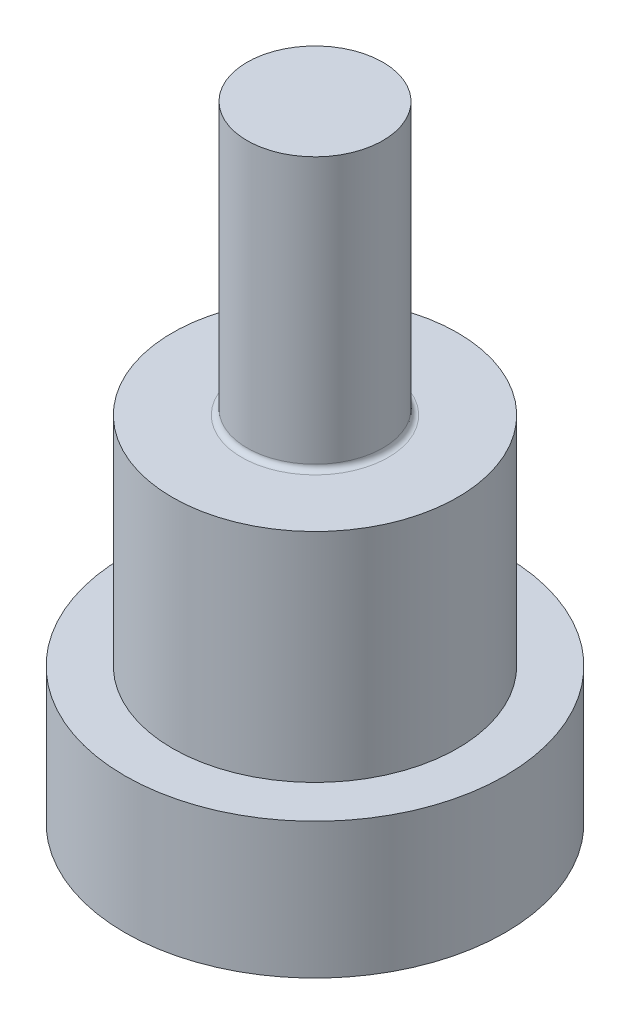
ISO-10303-21;
HEADER;
FILE_DESCRIPTION(('STEP AP214'),'2;1');
FILE_NAME('part.step','',(''),(''),'','','');
FILE_SCHEMA(('AUTOMOTIVE_DESIGN { 1 0 10303 214 1 1 1 1 }'));
ENDSEC;
DATA;
#1=APPLICATION_CONTEXT('core data for automotive mechanical design processes');
#2=APPLICATION_PROTOCOL_DEFINITION('international standard','automotive_design',2000,#1);
#3=PRODUCT_CONTEXT('',#1,'mechanical');
#4=PRODUCT('Part','Part','',(#3));
#5=PRODUCT_RELATED_PRODUCT_CATEGORY('part','',(#4));
#6=PRODUCT_DEFINITION_FORMATION('','',#4);
#7=PRODUCT_DEFINITION_CONTEXT('part definition',#1,'design');
#8=PRODUCT_DEFINITION('design','',#6,#7);
#9=PRODUCT_DEFINITION_SHAPE('','',#8);
#10=(LENGTH_UNIT() NAMED_UNIT(*) SI_UNIT(.MILLI.,.METRE.));
#11=(NAMED_UNIT(*) PLANE_ANGLE_UNIT() SI_UNIT($,.RADIAN.));
#12=(NAMED_UNIT(*) SI_UNIT($,.STERADIAN.) SOLID_ANGLE_UNIT());
#13=UNCERTAINTY_MEASURE_WITH_UNIT(LENGTH_MEASURE(1.E-05),#10,'distance_accuracy_value','');
#14=(GEOMETRIC_REPRESENTATION_CONTEXT(3) GLOBAL_UNCERTAINTY_ASSIGNED_CONTEXT((#13)) GLOBAL_UNIT_ASSIGNED_CONTEXT((#10,
#11,#12)) REPRESENTATION_CONTEXT('',''));
#15=CARTESIAN_POINT('',(0.,0.,0.));
#16=DIRECTION('',(0.,0.,1.));
#17=DIRECTION('',(1.,0.,0.));
#18=AXIS2_PLACEMENT_3D('',#15,#16,#17);
#19=CARTESIAN_POINT('',(0.,-6.,0.));
#20=DIRECTION('',(0.,-1.,0.));
#21=DIRECTION('',(-0.546944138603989,0.,0.837169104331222));
#22=AXIS2_PLACEMENT_3D('',#19,#20,#21);
#23=PLANE('',#22);
#24=CARTESIAN_POINT('',(0.,-6.,0.));
#25=DIRECTION('',(0.,-1.,0.));
#26=DIRECTION('',(-0.546944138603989,0.,0.837169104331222));
#27=AXIS2_PLACEMENT_3D('',#24,#25,#26);
#28=CIRCLE('',#27,3.2);
#29=CARTESIAN_POINT('',(-1.75022124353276,-6.,2.67894113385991));
#30=VERTEX_POINT('',#29);
#31=EDGE_CURVE('E123',#30,#30,#28,.F.);
#32=ORIENTED_EDGE('',*,*,#31,.T.);
#33=EDGE_LOOP('',(#32));
#34=FACE_BOUND('',#33,.T.);
#35=CARTESIAN_POINT('',(0.,-6.,0.));
#36=DIRECTION('',(0.,-1.,0.));
#37=DIRECTION('',(0.,0.,-1.));
#38=AXIS2_PLACEMENT_3D('',#35,#36,#37);
#39=CIRCLE('',#38,7.);
#40=CARTESIAN_POINT('',(0.,-6.,-7.));
#41=VERTEX_POINT('',#40);
#42=EDGE_CURVE('E393',#41,#41,#39,.T.);
#43=ORIENTED_EDGE('',*,*,#42,.T.);
#44=EDGE_LOOP('',(#43));
#45=FACE_BOUND('',#44,.T.);
#46=ADVANCED_FACE('F16',(#34,#45),#23,.T.);
#47=CARTESIAN_POINT('',(0.,-2.,0.));
#48=DIRECTION('',(0.,-1.,0.));
#49=DIRECTION('',(-0.546944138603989,0.,0.837169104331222));
#50=AXIS2_PLACEMENT_3D('',#47,#48,#49);
#51=CYLINDRICAL_SURFACE('',#50,3.);
#52=CARTESIAN_POINT('',(0.,-5.8,0.));
#53=DIRECTION('',(0.,-1.,0.));
#54=DIRECTION('',(-0.546944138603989,0.,0.837169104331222));
#55=AXIS2_PLACEMENT_3D('',#52,#53,#54);
#56=CIRCLE('',#55,3.);
#57=CARTESIAN_POINT('',(-1.64083241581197,-5.8,2.51150731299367));
#58=VERTEX_POINT('',#57);
#59=EDGE_CURVE('E126',#58,#58,#56,.T.);
#60=ORIENTED_EDGE('',*,*,#59,.T.);
#61=EDGE_LOOP('',(#60));
#62=FACE_BOUND('',#61,.T.);
#63=CARTESIAN_POINT('',(0.,-2.,0.));
#64=DIRECTION('',(0.,-1.,0.));
#65=DIRECTION('',(-0.546944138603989,0.,0.837169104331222));
#66=AXIS2_PLACEMENT_3D('',#63,#64,#65);
#67=CIRCLE('',#66,3.);
#68=CARTESIAN_POINT('',(-1.64083241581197,-2.,2.51150731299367));
#69=VERTEX_POINT('',#68);
#70=EDGE_CURVE('E120',#69,#69,#67,.T.);
#71=ORIENTED_EDGE('',*,*,#70,.F.);
#72=EDGE_LOOP('',(#71));
#73=FACE_BOUND('',#72,.T.);
#74=ADVANCED_FACE('F160',(#62,#73),#51,.F.);
#75=CARTESIAN_POINT('',(0.,-5.8,0.));
#76=DIRECTION('',(0.,-1.,0.));
#77=DIRECTION('',(-0.546944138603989,0.,0.837169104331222));
#78=AXIS2_PLACEMENT_3D('',#75,#76,#77);
#79=CONICAL_SURFACE('',#78,3.,0.785398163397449);
#80=ORIENTED_EDGE('',*,*,#31,.F.);
#81=EDGE_LOOP('',(#80));
#82=FACE_BOUND('',#81,.T.);
#83=ORIENTED_EDGE('',*,*,#59,.F.);
#84=EDGE_LOOP('',(#83));
#85=FACE_BOUND('',#84,.T.);
#86=ADVANCED_FACE('F167',(#82,#85),#79,.F.);
#87=CARTESIAN_POINT('',(0.,-2.,0.));
#88=DIRECTION('',(0.,-1.,0.));
#89=DIRECTION('',(0.,0.,-1.));
#90=AXIS2_PLACEMENT_3D('',#87,#88,#89);
#91=PLANE('',#90);
#92=CARTESIAN_POINT('',(0.,-2.,0.));
#93=DIRECTION('',(0.,-1.,0.));
#94=DIRECTION('',(0.,0.,-1.));
#95=AXIS2_PLACEMENT_3D('',#92,#93,#94);
#96=CIRCLE('',#95,2.75);
#97=CARTESIAN_POINT('',(0.,-2.,-2.75000000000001));
#98=VERTEX_POINT('',#97);
#99=EDGE_CURVE('E10',#98,#98,#96,.T.);
#100=ORIENTED_EDGE('',*,*,#99,.F.);
#101=EDGE_LOOP('',(#100));
#102=FACE_BOUND('',#101,.T.);
#103=ORIENTED_EDGE('',*,*,#70,.T.);
#104=EDGE_LOOP('',(#103));
#105=FACE_BOUND('',#104,.T.);
#106=ADVANCED_FACE('F177',(#102,#105),#91,.T.);
#107=CARTESIAN_POINT('',(0.,-3.5,1.44337567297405));
#108=DIRECTION('',(-0.5,0.,-0.86602540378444));
#109=DIRECTION('',(0.86602540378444,0.,-0.5));
#110=AXIS2_PLACEMENT_3D('',#107,#108,#109);
#111=PLANE('',#110);
#112=DIRECTION('',(0.,-1.,0.));
#113=VECTOR('',#112,1.);
#114=CARTESIAN_POINT('',(1.25,-3.5,0.721687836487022));
#115=LINE('',#114,#113);
#116=CARTESIAN_POINT('',(1.25,-3.5,0.721687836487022));
#117=VERTEX_POINT('',#116);
#118=CARTESIAN_POINT('',(1.25,-5.,0.721687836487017));
#119=VERTEX_POINT('',#118);
#120=EDGE_CURVE('E65',#117,#119,#115,.T.);
#121=ORIENTED_EDGE('',*,*,#120,.T.);
#122=DIRECTION('',(0.866025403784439,0.,-0.5));
#123=VECTOR('',#122,1.);
#124=CARTESIAN_POINT('',(0.,-5.,1.44337567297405));
#125=LINE('',#124,#123);
#126=CARTESIAN_POINT('',(0.,-5.,1.44337567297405));
#127=VERTEX_POINT('',#126);
#128=EDGE_CURVE('E31',#127,#119,#125,.T.);
#129=ORIENTED_EDGE('',*,*,#128,.F.);
#130=DIRECTION('',(0.,-1.,0.));
#131=VECTOR('',#130,1.);
#132=CARTESIAN_POINT('',(0.,-3.5,1.44337567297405));
#133=LINE('',#132,#131);
#134=CARTESIAN_POINT('',(0.,-3.5,1.44337567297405));
#135=VERTEX_POINT('',#134);
#136=EDGE_CURVE('E35',#135,#127,#133,.T.);
#137=ORIENTED_EDGE('',*,*,#136,.F.);
#138=DIRECTION('',(0.866025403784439,0.,-0.5));
#139=VECTOR('',#138,1.);
#140=CARTESIAN_POINT('',(0.,-3.5,1.44337567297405));
#141=LINE('',#140,#139);
#142=EDGE_CURVE('E68',#135,#117,#141,.T.);
#143=ORIENTED_EDGE('',*,*,#142,.T.);
#144=EDGE_LOOP('',(#121,#129,#137,#143));
#145=FACE_BOUND('',#144,.T.);
#146=ADVANCED_FACE('F67',(#145),#111,.T.);
#147=CARTESIAN_POINT('',(1.25,-3.5,-0.721687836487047));
#148=DIRECTION('',(1.,0.,0.));
#149=DIRECTION('',(0.,0.,1.));
#150=AXIS2_PLACEMENT_3D('',#147,#148,#149);
#151=PLANE('',#150);
#152=DIRECTION('',(0.,-1.,0.));
#153=VECTOR('',#152,1.);
#154=CARTESIAN_POINT('',(1.25,-3.5,-0.721687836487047));
#155=LINE('',#154,#153);
#156=CARTESIAN_POINT('',(1.25,-3.5,-0.721687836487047));
#157=VERTEX_POINT('',#156);
#158=CARTESIAN_POINT('',(1.25,-5.,-0.721687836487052));
#159=VERTEX_POINT('',#158);
#160=EDGE_CURVE('E73',#157,#159,#155,.T.);
#161=ORIENTED_EDGE('',*,*,#160,.T.);
#162=DIRECTION('',(0.,0.,1.));
#163=VECTOR('',#162,1.);
#164=CARTESIAN_POINT('',(1.25,-5.,-0.721687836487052));
#165=LINE('',#164,#163);
#166=EDGE_CURVE('E76',#159,#119,#165,.T.);
#167=ORIENTED_EDGE('',*,*,#166,.T.);
#168=ORIENTED_EDGE('',*,*,#120,.F.);
#169=DIRECTION('',(0.,0.,1.));
#170=VECTOR('',#169,1.);
#171=CARTESIAN_POINT('',(1.25,-3.5,-0.721687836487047));
#172=LINE('',#171,#170);
#173=EDGE_CURVE('E107',#157,#117,#172,.T.);
#174=ORIENTED_EDGE('',*,*,#173,.F.);
#175=EDGE_LOOP('',(#161,#167,#168,#174));
#176=FACE_BOUND('',#175,.T.);
#177=ADVANCED_FACE('F77',(#176),#151,.F.);
#178=CARTESIAN_POINT('',(0.,-3.5,-1.44337567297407));
#179=DIRECTION('',(0.5,0.,-0.86602540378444));
#180=DIRECTION('',(0.86602540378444,0.,0.5));
#181=AXIS2_PLACEMENT_3D('',#178,#179,#180);
#182=PLANE('',#181);
#183=DIRECTION('',(0.,-1.,0.));
#184=VECTOR('',#183,1.);
#185=CARTESIAN_POINT('',(0.,-3.5,-1.44337567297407));
#186=LINE('',#185,#184);
#187=CARTESIAN_POINT('',(0.,-3.5,-1.44337567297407));
#188=VERTEX_POINT('',#187);
#189=CARTESIAN_POINT('',(0.,-5.,-1.44337567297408));
#190=VERTEX_POINT('',#189);
#191=EDGE_CURVE('E115',#188,#190,#186,.T.);
#192=ORIENTED_EDGE('',*,*,#191,.T.);
#193=DIRECTION('',(0.86602540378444,0.,0.5));
#194=VECTOR('',#193,1.);
#195=CARTESIAN_POINT('',(0.,-5.,-1.44337567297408));
#196=LINE('',#195,#194);
#197=EDGE_CURVE('E81',#190,#159,#196,.T.);
#198=ORIENTED_EDGE('',*,*,#197,.T.);
#199=ORIENTED_EDGE('',*,*,#160,.F.);
#200=DIRECTION('',(0.86602540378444,0.,0.5));
#201=VECTOR('',#200,1.);
#202=CARTESIAN_POINT('',(0.,-3.5,-1.44337567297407));
#203=LINE('',#202,#201);
#204=EDGE_CURVE('E104',#188,#157,#203,.T.);
#205=ORIENTED_EDGE('',*,*,#204,.F.);
#206=EDGE_LOOP('',(#192,#198,#199,#205));
#207=FACE_BOUND('',#206,.T.);
#208=ADVANCED_FACE('F222',(#207),#182,.F.);
#209=CARTESIAN_POINT('',(0.,-3.5,-1.44337567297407));
#210=DIRECTION('',(0.5,0.,0.86602540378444));
#211=DIRECTION('',(-0.86602540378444,0.,0.5));
#212=AXIS2_PLACEMENT_3D('',#209,#210,#211);
#213=PLANE('',#212);
#214=DIRECTION('',(0.,-1.,0.));
#215=VECTOR('',#214,1.);
#216=CARTESIAN_POINT('',(-1.25,-3.5,-0.721687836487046));
#217=LINE('',#216,#215);
#218=CARTESIAN_POINT('',(-1.25,-3.5,-0.721687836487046));
#219=VERTEX_POINT('',#218);
#220=CARTESIAN_POINT('',(-1.25,-5.,-0.721687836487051));
#221=VERTEX_POINT('',#220);
#222=EDGE_CURVE('E113',#219,#221,#217,.T.);
#223=ORIENTED_EDGE('',*,*,#222,.T.);
#224=DIRECTION('',(-0.86602540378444,0.,0.5));
#225=VECTOR('',#224,1.);
#226=CARTESIAN_POINT('',(0.,-5.,-1.44337567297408));
#227=LINE('',#226,#225);
#228=EDGE_CURVE('E384',#190,#221,#227,.T.);
#229=ORIENTED_EDGE('',*,*,#228,.F.);
#230=ORIENTED_EDGE('',*,*,#191,.F.);
#231=DIRECTION('',(-0.86602540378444,0.,0.5));
#232=VECTOR('',#231,1.);
#233=CARTESIAN_POINT('',(0.,-3.5,-1.44337567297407));
#234=LINE('',#233,#232);
#235=EDGE_CURVE('E101',#188,#219,#234,.T.);
#236=ORIENTED_EDGE('',*,*,#235,.T.);
#237=EDGE_LOOP('',(#223,#229,#230,#236));
#238=FACE_BOUND('',#237,.T.);
#239=ADVANCED_FACE('F215',(#238),#213,.T.);
#240=CARTESIAN_POINT('',(-1.25,-3.5,0.721687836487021));
#241=DIRECTION('',(-1.,0.,0.));
#242=DIRECTION('',(0.,0.,-1.));
#243=AXIS2_PLACEMENT_3D('',#240,#241,#242);
#244=PLANE('',#243);
#245=DIRECTION('',(0.,-1.,0.));
#246=VECTOR('',#245,1.);
#247=CARTESIAN_POINT('',(-1.25,-3.5,0.721687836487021));
#248=LINE('',#247,#246);
#249=CARTESIAN_POINT('',(-1.25,-3.5,0.721687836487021));
#250=VERTEX_POINT('',#249);
#251=CARTESIAN_POINT('',(-1.25,-5.,0.721687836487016));
#252=VERTEX_POINT('',#251);
#253=EDGE_CURVE('E111',#250,#252,#248,.T.);
#254=ORIENTED_EDGE('',*,*,#253,.T.);
#255=DIRECTION('',(0.,0.,-1.));
#256=VECTOR('',#255,1.);
#257=CARTESIAN_POINT('',(-1.25,-5.,0.721687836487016));
#258=LINE('',#257,#256);
#259=EDGE_CURVE('E386',#252,#221,#258,.T.);
#260=ORIENTED_EDGE('',*,*,#259,.T.);
#261=ORIENTED_EDGE('',*,*,#222,.F.);
#262=DIRECTION('',(0.,0.,-1.));
#263=VECTOR('',#262,1.);
#264=CARTESIAN_POINT('',(-1.25,-3.5,0.721687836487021));
#265=LINE('',#264,#263);
#266=EDGE_CURVE('E98',#250,#219,#265,.T.);
#267=ORIENTED_EDGE('',*,*,#266,.F.);
#268=EDGE_LOOP('',(#254,#260,#261,#267));
#269=FACE_BOUND('',#268,.T.);
#270=ADVANCED_FACE('F207',(#269),#244,.F.);
#271=CARTESIAN_POINT('',(0.,-3.5,1.44337567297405));
#272=DIRECTION('',(-0.5,0.,0.86602540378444));
#273=DIRECTION('',(-0.86602540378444,0.,-0.5));
#274=AXIS2_PLACEMENT_3D('',#271,#272,#273);
#275=PLANE('',#274);
#276=DIRECTION('',(-0.86602540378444,0.,-0.5));
#277=VECTOR('',#276,1.);
#278=CARTESIAN_POINT('',(0.,-3.5,1.44337567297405));
#279=LINE('',#278,#277);
#280=EDGE_CURVE('E95',#135,#250,#279,.T.);
#281=ORIENTED_EDGE('',*,*,#280,.F.);
#282=ORIENTED_EDGE('',*,*,#136,.T.);
#283=DIRECTION('',(-0.86602540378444,0.,-0.5));
#284=VECTOR('',#283,1.);
#285=CARTESIAN_POINT('',(0.,-5.,1.44337567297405));
#286=LINE('',#285,#284);
#287=EDGE_CURVE('E87',#127,#252,#286,.T.);
#288=ORIENTED_EDGE('',*,*,#287,.T.);
#289=ORIENTED_EDGE('',*,*,#253,.F.);
#290=EDGE_LOOP('',(#281,#282,#288,#289));
#291=FACE_BOUND('',#290,.T.);
#292=ADVANCED_FACE('F200',(#291),#275,.F.);
#293=CARTESIAN_POINT('',(1.25,-3.5,0.721687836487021));
#294=DIRECTION('',(0.,-1.,0.));
#295=DIRECTION('',(1.,0.,0.));
#296=AXIS2_PLACEMENT_3D('',#293,#294,#295);
#297=PLANE('',#296);
#298=ORIENTED_EDGE('',*,*,#142,.F.);
#299=ORIENTED_EDGE('',*,*,#280,.T.);
#300=ORIENTED_EDGE('',*,*,#266,.T.);
#301=ORIENTED_EDGE('',*,*,#235,.F.);
#302=ORIENTED_EDGE('',*,*,#204,.T.);
#303=ORIENTED_EDGE('',*,*,#173,.T.);
#304=EDGE_LOOP('',(#298,#299,#300,#301,#302,#303));
#305=FACE_BOUND('',#304,.T.);
#306=ADVANCED_FACE('F199',(#305),#297,.T.);
#307=CARTESIAN_POINT('',(0.,-5.,0.));
#308=DIRECTION('',(0.,-1.,0.));
#309=DIRECTION('',(1.,0.,0.));
#310=AXIS2_PLACEMENT_3D('',#307,#308,#309);
#311=PLANE('',#310);
#312=CARTESIAN_POINT('',(0.,-5.,0.));
#313=DIRECTION('',(0.,-1.,0.));
#314=DIRECTION('',(1.,0.,0.));
#315=AXIS2_PLACEMENT_3D('',#312,#313,#314);
#316=CIRCLE('',#315,2.75);
#317=CARTESIAN_POINT('',(2.75,-5.,0.));
#318=VERTEX_POINT('',#317);
#319=EDGE_CURVE('E72',#318,#318,#316,.T.);
#320=ORIENTED_EDGE('',*,*,#319,.T.);
#321=EDGE_LOOP('',(#320));
#322=FACE_BOUND('',#321,.T.);
#323=ORIENTED_EDGE('',*,*,#287,.F.);
#324=ORIENTED_EDGE('',*,*,#128,.T.);
#325=ORIENTED_EDGE('',*,*,#166,.F.);
#326=ORIENTED_EDGE('',*,*,#197,.F.);
#327=ORIENTED_EDGE('',*,*,#228,.T.);
#328=ORIENTED_EDGE('',*,*,#259,.F.);
#329=EDGE_LOOP('',(#323,#324,#325,#326,#327,#328));
#330=FACE_BOUND('',#329,.T.);
#331=ADVANCED_FACE('F84',(#322,#330),#311,.T.);
#332=CARTESIAN_POINT('',(0.,-17.,0.));
#333=DIRECTION('',(0.,-1.,0.));
#334=DIRECTION('',(1.,0.,0.));
#335=AXIS2_PLACEMENT_3D('',#332,#333,#334);
#336=CYLINDRICAL_SURFACE('',#335,2.75);
#337=ORIENTED_EDGE('',*,*,#99,.T.);
#338=EDGE_LOOP('',(#337));
#339=FACE_BOUND('',#338,.T.);
#340=ORIENTED_EDGE('',*,*,#319,.F.);
#341=EDGE_LOOP('',(#340));
#342=FACE_BOUND('',#341,.T.);
#343=ADVANCED_FACE('F191',(#339,#342),#336,.T.);
#344=CARTESIAN_POINT('',(0.,17.,0.));
#345=DIRECTION('',(0.,-1.,0.));
#346=DIRECTION('',(0.,0.,-1.));
#347=AXIS2_PLACEMENT_3D('',#344,#345,#346);
#348=PLANE('',#347);
#349=CARTESIAN_POINT('',(0.,17.,0.));
#350=DIRECTION('',(0.,-1.,0.));
#351=DIRECTION('',(0.,0.,-1.));
#352=AXIS2_PLACEMENT_3D('',#349,#350,#351);
#353=CIRCLE('',#352,2.5);
#354=CARTESIAN_POINT('',(0.,17.,-2.5));
#355=VERTEX_POINT('',#354);
#356=EDGE_CURVE('E88',#355,#355,#353,.T.);
#357=ORIENTED_EDGE('',*,*,#356,.F.);
#358=EDGE_LOOP('',(#357));
#359=FACE_BOUND('',#358,.T.);
#360=ADVANCED_FACE('F194',(#359),#348,.F.);
#361=CARTESIAN_POINT('',(0.,17.,0.));
#362=DIRECTION('',(0.,1.,0.));
#363=DIRECTION('',(0.,0.,1.));
#364=AXIS2_PLACEMENT_3D('',#361,#362,#363);
#365=CYLINDRICAL_SURFACE('',#364,2.5);
#366=CARTESIAN_POINT('',(0.,7.2,0.));
#367=DIRECTION('',(0.,-1.,0.));
#368=DIRECTION('',(0.,0.,-1.));
#369=AXIS2_PLACEMENT_3D('',#366,#367,#368);
#370=CIRCLE('',#369,2.5);
#371=CARTESIAN_POINT('',(0.,7.2,-2.5));
#372=VERTEX_POINT('',#371);
#373=EDGE_CURVE('E132',#372,#372,#370,.F.);
#374=ORIENTED_EDGE('',*,*,#373,.T.);
#375=EDGE_LOOP('',(#374));
#376=FACE_BOUND('',#375,.T.);
#377=ORIENTED_EDGE('',*,*,#356,.T.);
#378=EDGE_LOOP('',(#377));
#379=FACE_BOUND('',#378,.T.);
#380=ADVANCED_FACE('F353',(#376,#379),#365,.T.);
#381=CARTESIAN_POINT('',(0.,7.2,0.));
#382=DIRECTION('',(0.,-1.,0.));
#383=DIRECTION('',(0.,0.,-1.));
#384=AXIS2_PLACEMENT_3D('',#381,#382,#383);
#385=TOROIDAL_SURFACE('',#384,2.7,0.2);
#386=CARTESIAN_POINT('',(0.,7.,0.));
#387=DIRECTION('',(0.,-1.,0.));
#388=DIRECTION('',(0.,0.,-1.));
#389=AXIS2_PLACEMENT_3D('',#386,#387,#388);
#390=CIRCLE('',#389,2.7);
#391=CARTESIAN_POINT('',(0.,7.,-2.7));
#392=VERTEX_POINT('',#391);
#393=EDGE_CURVE('E135',#392,#392,#390,.T.);
#394=ORIENTED_EDGE('',*,*,#393,.F.);
#395=EDGE_LOOP('',(#394));
#396=FACE_BOUND('',#395,.T.);
#397=ORIENTED_EDGE('',*,*,#373,.F.);
#398=EDGE_LOOP('',(#397));
#399=FACE_BOUND('',#398,.T.);
#400=ADVANCED_FACE('F18',(#396,#399),#385,.F.);
#401=CARTESIAN_POINT('',(2.5,7.,0.));
#402=DIRECTION('',(0.,-1.,0.));
#403=DIRECTION('',(0.,0.,-1.));
#404=AXIS2_PLACEMENT_3D('',#401,#402,#403);
#405=PLANE('',#404);
#406=ORIENTED_EDGE('',*,*,#393,.T.);
#407=EDGE_LOOP('',(#406));
#408=FACE_BOUND('',#407,.T.);
#409=CARTESIAN_POINT('',(0.,7.,0.));
#410=DIRECTION('',(0.,-1.,0.));
#411=DIRECTION('',(0.,0.,-1.));
#412=AXIS2_PLACEMENT_3D('',#409,#410,#411);
#413=CIRCLE('',#412,5.25);
#414=CARTESIAN_POINT('',(0.,7.,-5.25));
#415=VERTEX_POINT('',#414);
#416=EDGE_CURVE('E129',#415,#415,#413,.T.);
#417=ORIENTED_EDGE('',*,*,#416,.F.);
#418=EDGE_LOOP('',(#417));
#419=FACE_BOUND('',#418,.T.);
#420=ADVANCED_FACE('F145',(#408,#419),#405,.F.);
#421=CARTESIAN_POINT('',(0.,17.,0.));
#422=DIRECTION('',(0.,1.,0.));
#423=DIRECTION('',(0.,0.,1.));
#424=AXIS2_PLACEMENT_3D('',#421,#422,#423);
#425=CYLINDRICAL_SURFACE('',#424,5.25);
#426=ORIENTED_EDGE('',*,*,#416,.T.);
#427=EDGE_LOOP('',(#426));
#428=FACE_BOUND('',#427,.T.);
#429=CARTESIAN_POINT('',(0.,-1.,0.));
#430=DIRECTION('',(0.,-1.,0.));
#431=DIRECTION('',(0.,0.,-1.));
#432=AXIS2_PLACEMENT_3D('',#429,#430,#431);
#433=CIRCLE('',#432,5.25);
#434=CARTESIAN_POINT('',(0.,-1.,-5.25));
#435=VERTEX_POINT('',#434);
#436=EDGE_CURVE('E24',#435,#435,#433,.T.);
#437=ORIENTED_EDGE('',*,*,#436,.F.);
#438=EDGE_LOOP('',(#437));
#439=FACE_BOUND('',#438,.T.);
#440=ADVANCED_FACE('F143',(#428,#439),#425,.T.);
#441=CARTESIAN_POINT('',(0.,-1.,0.));
#442=DIRECTION('',(0.,-1.,0.));
#443=DIRECTION('',(-0.546944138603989,0.,0.837169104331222));
#444=AXIS2_PLACEMENT_3D('',#441,#442,#443);
#445=PLANE('',#444);
#446=ORIENTED_EDGE('',*,*,#436,.T.);
#447=EDGE_LOOP('',(#446));
#448=FACE_BOUND('',#447,.T.);
#449=CARTESIAN_POINT('',(0.,-1.,0.));
#450=DIRECTION('',(0.,-1.,0.));
#451=DIRECTION('',(0.,0.,-1.));
#452=AXIS2_PLACEMENT_3D('',#449,#450,#451);
#453=CIRCLE('',#452,7.);
#454=CARTESIAN_POINT('',(0.,-1.,-7.));
#455=VERTEX_POINT('',#454);
#456=EDGE_CURVE('E91',#455,#455,#453,.T.);
#457=ORIENTED_EDGE('',*,*,#456,.F.);
#458=EDGE_LOOP('',(#457));
#459=FACE_BOUND('',#458,.T.);
#460=ADVANCED_FACE('F140',(#448,#459),#445,.F.);
#461=CARTESIAN_POINT('',(0.,-6.,0.));
#462=DIRECTION('',(0.,1.,0.));
#463=DIRECTION('',(0.546944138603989,0.,-0.837169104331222));
#464=AXIS2_PLACEMENT_3D('',#461,#462,#463);
#465=CYLINDRICAL_SURFACE('',#464,7.);
#466=ORIENTED_EDGE('',*,*,#456,.T.);
#467=EDGE_LOOP('',(#466));
#468=FACE_BOUND('',#467,.T.);
#469=ORIENTED_EDGE('',*,*,#42,.F.);
#470=EDGE_LOOP('',(#469));
#471=FACE_BOUND('',#470,.T.);
#472=ADVANCED_FACE('F154',(#468,#471),#465,.T.);
#473=CLOSED_SHELL('',(#46,#74,#86,#106,#146,#177,#208,#239,#270,#292,#306,#331,#343,#360,#380,
#400,#420,#440,#460,#472));
#474=MANIFOLD_SOLID_BREP('B1',#473);
#475=ADVANCED_BREP_SHAPE_REPRESENTATION('',(#18,#474),#14);
#476=SHAPE_DEFINITION_REPRESENTATION(#9,#475);
ENDSEC;
END-ISO-10303-21;
